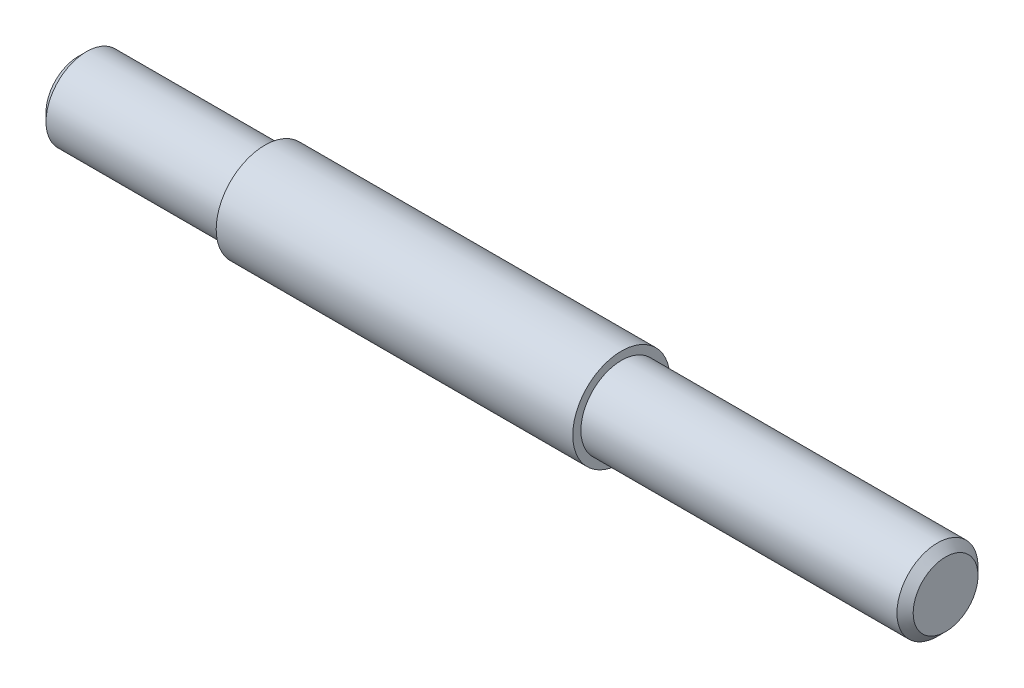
from build123d import *

# Parameters (mm, degrees)
CHANFREIN1_SIZE = 1


with BuildPart() as part:
    # Esquisse1 → R_volution1 (revolve)
    with BuildSketch(Plane.XY, mode=Mode.PRIVATE) as r_volution1_sk:
        Polygon((0, 0), (0, 5), (23, 5), (23, 6), (67, 6), (67, 5), (107, 5), (107, 0), align=None)
    revolve(r_volution1_sk.sketch.rotate(Axis((-12.188590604, 0, 0), (1, 0, 0)), 90), axis=Axis((-12.188590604, 0, 0), (1, 0, 0)))

    # Chanfrein1
    chanfrein1_edges = [part.edges().sort_by_distance(p)[0] for p in [
        (0, 0, -5),
        (107, 0, -5),
    ]]
    chamfer(chanfrein1_edges, length=CHANFREIN1_SIZE)


solid = part.part
